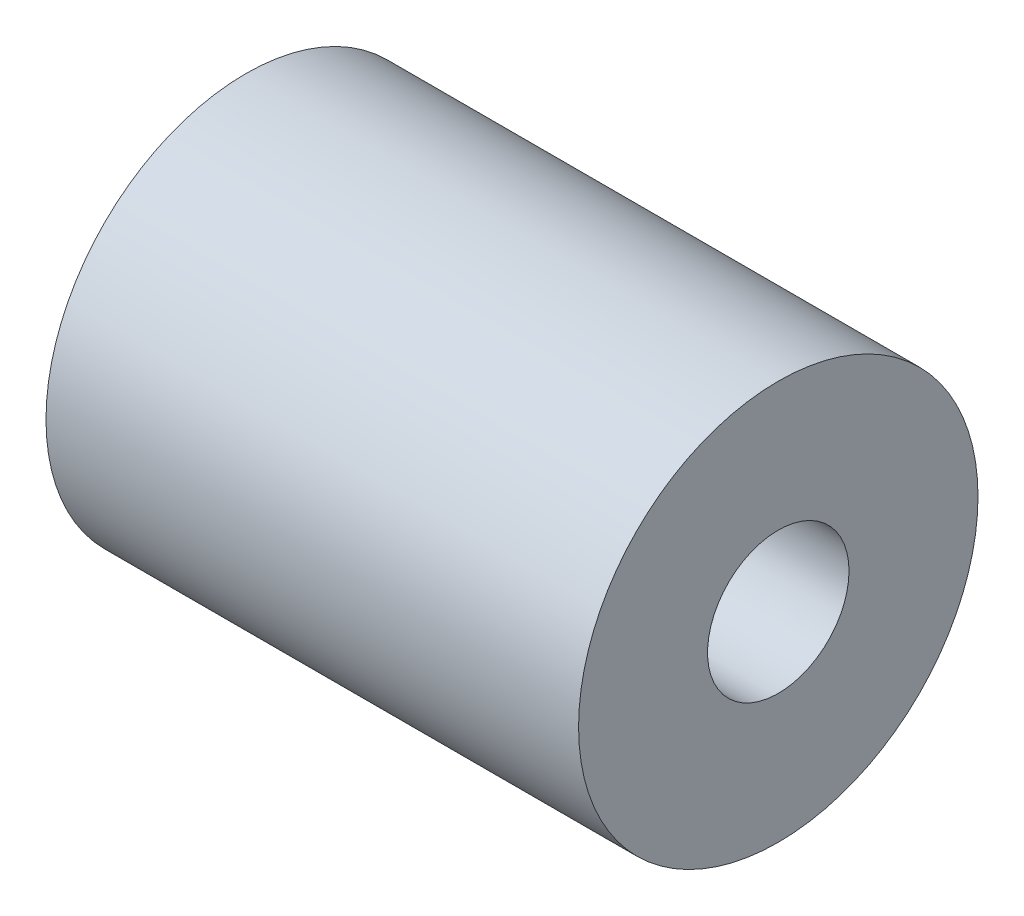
ISO-10303-21;
HEADER;
FILE_DESCRIPTION(('STEP AP214'),'2;1');
FILE_NAME('part.step','',(''),(''),'','','');
FILE_SCHEMA(('AUTOMOTIVE_DESIGN { 1 0 10303 214 1 1 1 1 }'));
ENDSEC;
DATA;
#1=APPLICATION_CONTEXT('core data for automotive mechanical design processes');
#2=APPLICATION_PROTOCOL_DEFINITION('international standard','automotive_design',2000,#1);
#3=PRODUCT_CONTEXT('',#1,'mechanical');
#4=PRODUCT('Part','Part','',(#3));
#5=PRODUCT_RELATED_PRODUCT_CATEGORY('part','',(#4));
#6=PRODUCT_DEFINITION_FORMATION('','',#4);
#7=PRODUCT_DEFINITION_CONTEXT('part definition',#1,'design');
#8=PRODUCT_DEFINITION('design','',#6,#7);
#9=PRODUCT_DEFINITION_SHAPE('','',#8);
#10=(LENGTH_UNIT() NAMED_UNIT(*) SI_UNIT(.MILLI.,.METRE.));
#11=(NAMED_UNIT(*) PLANE_ANGLE_UNIT() SI_UNIT($,.RADIAN.));
#12=(NAMED_UNIT(*) SI_UNIT($,.STERADIAN.) SOLID_ANGLE_UNIT());
#13=UNCERTAINTY_MEASURE_WITH_UNIT(LENGTH_MEASURE(1.E-05),#10,'distance_accuracy_value','');
#14=(GEOMETRIC_REPRESENTATION_CONTEXT(3) GLOBAL_UNCERTAINTY_ASSIGNED_CONTEXT((#13)) GLOBAL_UNIT_ASSIGNED_CONTEXT((#10,
#11,#12)) REPRESENTATION_CONTEXT('',''));
#15=CARTESIAN_POINT('',(0.,0.,0.));
#16=DIRECTION('',(0.,0.,1.));
#17=DIRECTION('',(1.,0.,0.));
#18=AXIS2_PLACEMENT_3D('',#15,#16,#17);
#19=CARTESIAN_POINT('',(25.4000000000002,-2.22044604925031E-12,2.22044604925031E-13));
#20=DIRECTION('',(1.,0.,0.));
#21=DIRECTION('',(0.,0.,-1.));
#22=AXIS2_PLACEMENT_3D('',#19,#20,#21);
#23=PLANE('',#22);
#24=CARTESIAN_POINT('',(25.4000000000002,-2.22044604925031E-12,2.22044604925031E-13));
#25=DIRECTION('',(1.,0.,0.));
#26=DIRECTION('',(0.,0.,-1.));
#27=AXIS2_PLACEMENT_3D('',#24,#25,#26);
#28=CIRCLE('',#27,9.525);
#29=CARTESIAN_POINT('',(25.4000000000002,-2.22256102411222E-12,-9.52499999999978));
#30=VERTEX_POINT('',#29);
#31=EDGE_CURVE('E10',#30,#30,#28,.T.);
#32=ORIENTED_EDGE('',*,*,#31,.T.);
#33=EDGE_LOOP('',(#32));
#34=FACE_BOUND('',#33,.T.);
#35=CARTESIAN_POINT('',(25.4000000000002,-2.22044604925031E-12,2.22044604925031E-13));
#36=DIRECTION('',(1.,0.,0.));
#37=DIRECTION('',(0.,0.,-1.));
#38=AXIS2_PLACEMENT_3D('',#35,#36,#37);
#39=CIRCLE('',#38,3.37312);
#40=CARTESIAN_POINT('',(25.4000000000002,-2.22119503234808E-12,-3.37311999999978));
#41=VERTEX_POINT('',#40);
#42=EDGE_CURVE('E39',#41,#41,#39,.T.);
#43=ORIENTED_EDGE('',*,*,#42,.F.);
#44=EDGE_LOOP('',(#43));
#45=FACE_BOUND('',#44,.T.);
#46=ADVANCED_FACE('F28',(#34,#45),#23,.T.);
#47=CARTESIAN_POINT('',(2.22044604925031E-13,-8.88178419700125E-13,0.));
#48=DIRECTION('',(1.,0.,0.));
#49=DIRECTION('',(0.,0.,-1.));
#50=AXIS2_PLACEMENT_3D('',#47,#48,#49);
#51=PLANE('',#50);
#52=CARTESIAN_POINT('',(2.22044604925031E-13,-8.88178419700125E-13,0.));
#53=DIRECTION('',(1.,0.,0.));
#54=DIRECTION('',(0.,0.,-1.));
#55=AXIS2_PLACEMENT_3D('',#52,#53,#54);
#56=CIRCLE('',#55,9.525);
#57=CARTESIAN_POINT('',(2.20598399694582E-13,-8.90293394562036E-13,-9.525));
#58=VERTEX_POINT('',#57);
#59=EDGE_CURVE('E32',#58,#58,#56,.T.);
#60=ORIENTED_EDGE('',*,*,#59,.F.);
#61=EDGE_LOOP('',(#60));
#62=FACE_BOUND('',#61,.T.);
#63=CARTESIAN_POINT('',(2.22044604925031E-13,-8.88178419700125E-13,0.));
#64=DIRECTION('',(1.,0.,0.));
#65=DIRECTION('',(0.,0.,-1.));
#66=AXIS2_PLACEMENT_3D('',#63,#64,#65);
#67=CIRCLE('',#66,3.37312);
#68=CARTESIAN_POINT('',(2.21532455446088E-13,-8.8892740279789E-13,-3.37312));
#69=VERTEX_POINT('',#68);
#70=EDGE_CURVE('E41',#69,#69,#67,.T.);
#71=ORIENTED_EDGE('',*,*,#70,.T.);
#72=EDGE_LOOP('',(#71));
#73=FACE_BOUND('',#72,.T.);
#74=ADVANCED_FACE('F51',(#62,#73),#51,.F.);
#75=CARTESIAN_POINT('',(25.4000000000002,-2.22044604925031E-12,2.22044604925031E-13));
#76=DIRECTION('',(-1.,0.,0.));
#77=DIRECTION('',(0.,0.,1.));
#78=AXIS2_PLACEMENT_3D('',#75,#76,#77);
#79=CYLINDRICAL_SURFACE('',#78,9.525);
#80=ORIENTED_EDGE('',*,*,#31,.F.);
#81=EDGE_LOOP('',(#80));
#82=FACE_BOUND('',#81,.T.);
#83=ORIENTED_EDGE('',*,*,#59,.T.);
#84=EDGE_LOOP('',(#83));
#85=FACE_BOUND('',#84,.T.);
#86=ADVANCED_FACE('F30',(#82,#85),#79,.T.);
#87=CARTESIAN_POINT('',(25.4000000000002,-2.22044604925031E-12,2.22044604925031E-13));
#88=DIRECTION('',(-1.,0.,0.));
#89=DIRECTION('',(0.,0.,1.));
#90=AXIS2_PLACEMENT_3D('',#87,#88,#89);
#91=CYLINDRICAL_SURFACE('',#90,3.37312);
#92=ORIENTED_EDGE('',*,*,#42,.T.);
#93=EDGE_LOOP('',(#92));
#94=FACE_BOUND('',#93,.T.);
#95=ORIENTED_EDGE('',*,*,#70,.F.);
#96=EDGE_LOOP('',(#95));
#97=FACE_BOUND('',#96,.T.);
#98=ADVANCED_FACE('F47',(#94,#97),#91,.F.);
#99=CLOSED_SHELL('',(#46,#74,#86,#98));
#100=MANIFOLD_SOLID_BREP('B2',#99);
#101=ADVANCED_BREP_SHAPE_REPRESENTATION('',(#18,#100),#14);
#102=SHAPE_DEFINITION_REPRESENTATION(#9,#101);
ENDSEC;
END-ISO-10303-21;
